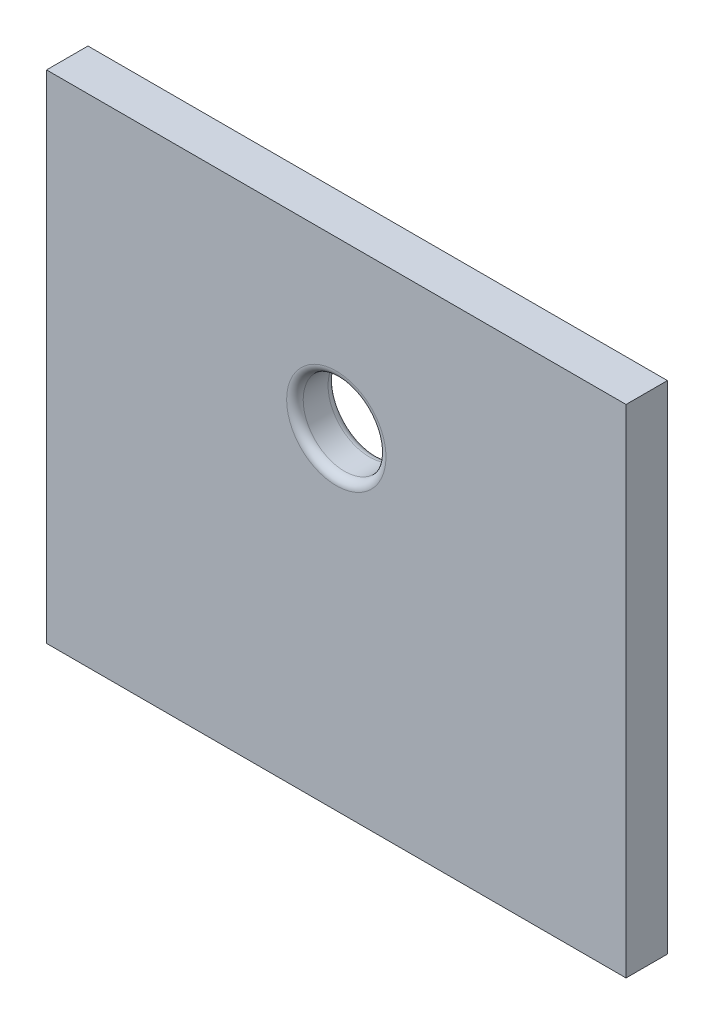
ISO-10303-21;
HEADER;
FILE_DESCRIPTION(('STEP AP214'),'2;1');
FILE_NAME('part.step','',(''),(''),'','','');
FILE_SCHEMA(('AUTOMOTIVE_DESIGN { 1 0 10303 214 1 1 1 1 }'));
ENDSEC;
DATA;
#1=APPLICATION_CONTEXT('core data for automotive mechanical design processes');
#2=APPLICATION_PROTOCOL_DEFINITION('international standard','automotive_design',2000,#1);
#3=PRODUCT_CONTEXT('',#1,'mechanical');
#4=PRODUCT('Part','Part','',(#3));
#5=PRODUCT_RELATED_PRODUCT_CATEGORY('part','',(#4));
#6=PRODUCT_DEFINITION_FORMATION('','',#4);
#7=PRODUCT_DEFINITION_CONTEXT('part definition',#1,'design');
#8=PRODUCT_DEFINITION('design','',#6,#7);
#9=PRODUCT_DEFINITION_SHAPE('','',#8);
#10=(LENGTH_UNIT() NAMED_UNIT(*) SI_UNIT(.MILLI.,.METRE.));
#11=(NAMED_UNIT(*) PLANE_ANGLE_UNIT() SI_UNIT($,.RADIAN.));
#12=(NAMED_UNIT(*) SI_UNIT($,.STERADIAN.) SOLID_ANGLE_UNIT());
#13=UNCERTAINTY_MEASURE_WITH_UNIT(LENGTH_MEASURE(1.E-05),#10,'distance_accuracy_value','');
#14=(GEOMETRIC_REPRESENTATION_CONTEXT(3) GLOBAL_UNCERTAINTY_ASSIGNED_CONTEXT((#13)) GLOBAL_UNIT_ASSIGNED_CONTEXT((#10,
#11,#12)) REPRESENTATION_CONTEXT('',''));
#15=CARTESIAN_POINT('',(0.,0.,0.));
#16=DIRECTION('',(0.,0.,1.));
#17=DIRECTION('',(1.,0.,0.));
#18=AXIS2_PLACEMENT_3D('',#15,#16,#17);
#19=CARTESIAN_POINT('',(0.,0.,5.));
#20=DIRECTION('',(0.,0.,-1.));
#21=DIRECTION('',(-1.,0.,0.));
#22=AXIS2_PLACEMENT_3D('',#19,#20,#21);
#23=PLANE('',#22);
#24=CARTESIAN_POINT('',(0.,10.,5.));
#25=DIRECTION('',(0.,0.,-1.));
#26=DIRECTION('',(-1.,0.,0.));
#27=AXIS2_PLACEMENT_3D('',#24,#25,#26);
#28=CIRCLE('',#27,6.);
#29=CARTESIAN_POINT('',(-6.,10.,5.));
#30=VERTEX_POINT('',#29);
#31=EDGE_CURVE('E11',#30,#30,#28,.T.);
#32=ORIENTED_EDGE('',*,*,#31,.T.);
#33=EDGE_LOOP('',(#32));
#34=FACE_BOUND('',#33,.T.);
#35=DIRECTION('',(0.,1.,0.));
#36=VECTOR('',#35,1.);
#37=CARTESIAN_POINT('',(35.,-30.,5.));
#38=LINE('',#37,#36);
#39=CARTESIAN_POINT('',(35.,-30.,5.));
#40=VERTEX_POINT('',#39);
#41=CARTESIAN_POINT('',(35.,30.,5.));
#42=VERTEX_POINT('',#41);
#43=EDGE_CURVE('E92',#40,#42,#38,.T.);
#44=ORIENTED_EDGE('',*,*,#43,.T.);
#45=DIRECTION('',(-1.,0.,0.));
#46=VECTOR('',#45,1.);
#47=CARTESIAN_POINT('',(-35.,30.,5.));
#48=LINE('',#47,#46);
#49=CARTESIAN_POINT('',(-35.,30.,5.));
#50=VERTEX_POINT('',#49);
#51=EDGE_CURVE('E88',#42,#50,#48,.T.);
#52=ORIENTED_EDGE('',*,*,#51,.T.);
#53=DIRECTION('',(0.,-1.,0.));
#54=VECTOR('',#53,1.);
#55=CARTESIAN_POINT('',(-35.,-30.,5.));
#56=LINE('',#55,#54);
#57=CARTESIAN_POINT('',(-35.,-30.,5.));
#58=VERTEX_POINT('',#57);
#59=EDGE_CURVE('E90',#50,#58,#56,.T.);
#60=ORIENTED_EDGE('',*,*,#59,.T.);
#61=DIRECTION('',(1.,0.,0.));
#62=VECTOR('',#61,1.);
#63=CARTESIAN_POINT('',(-35.,-30.,5.));
#64=LINE('',#63,#62);
#65=EDGE_CURVE('E57',#58,#40,#64,.T.);
#66=ORIENTED_EDGE('',*,*,#65,.T.);
#67=EDGE_LOOP('',(#44,#52,#60,#66));
#68=FACE_BOUND('',#67,.T.);
#69=ADVANCED_FACE('F40',(#34,#68),#23,.F.);
#70=CARTESIAN_POINT('',(0.,0.,0.));
#71=DIRECTION('',(0.,0.,-1.));
#72=DIRECTION('',(-1.,0.,0.));
#73=AXIS2_PLACEMENT_3D('',#70,#71,#72);
#74=PLANE('',#73);
#75=CARTESIAN_POINT('',(0.,10.,0.));
#76=DIRECTION('',(0.,0.,-1.));
#77=DIRECTION('',(-1.,0.,0.));
#78=AXIS2_PLACEMENT_3D('',#75,#76,#77);
#79=CIRCLE('',#78,6.);
#80=CARTESIAN_POINT('',(-6.,10.,0.));
#81=VERTEX_POINT('',#80);
#82=EDGE_CURVE('E116',#81,#81,#79,.F.);
#83=ORIENTED_EDGE('',*,*,#82,.T.);
#84=EDGE_LOOP('',(#83));
#85=FACE_BOUND('',#84,.T.);
#86=DIRECTION('',(0.,1.,0.));
#87=VECTOR('',#86,1.);
#88=CARTESIAN_POINT('',(35.,-30.,0.));
#89=LINE('',#88,#87);
#90=CARTESIAN_POINT('',(35.,-30.,0.));
#91=VERTEX_POINT('',#90);
#92=CARTESIAN_POINT('',(35.,30.,0.));
#93=VERTEX_POINT('',#92);
#94=EDGE_CURVE('E107',#91,#93,#89,.T.);
#95=ORIENTED_EDGE('',*,*,#94,.F.);
#96=DIRECTION('',(1.,0.,0.));
#97=VECTOR('',#96,1.);
#98=CARTESIAN_POINT('',(-35.,-30.,0.));
#99=LINE('',#98,#97);
#100=CARTESIAN_POINT('',(-35.,-30.,0.));
#101=VERTEX_POINT('',#100);
#102=EDGE_CURVE('E80',#101,#91,#99,.T.);
#103=ORIENTED_EDGE('',*,*,#102,.F.);
#104=DIRECTION('',(0.,-1.,0.));
#105=VECTOR('',#104,1.);
#106=CARTESIAN_POINT('',(-35.,-30.,0.));
#107=LINE('',#106,#105);
#108=CARTESIAN_POINT('',(-35.,30.,0.));
#109=VERTEX_POINT('',#108);
#110=EDGE_CURVE('E74',#109,#101,#107,.T.);
#111=ORIENTED_EDGE('',*,*,#110,.F.);
#112=DIRECTION('',(-1.,0.,0.));
#113=VECTOR('',#112,1.);
#114=CARTESIAN_POINT('',(-35.,30.,0.));
#115=LINE('',#114,#113);
#116=EDGE_CURVE('E97',#93,#109,#115,.T.);
#117=ORIENTED_EDGE('',*,*,#116,.F.);
#118=EDGE_LOOP('',(#95,#103,#111,#117));
#119=FACE_BOUND('',#118,.T.);
#120=ADVANCED_FACE('F132',(#85,#119),#74,.T.);
#121=CARTESIAN_POINT('',(35.,-30.,5.));
#122=DIRECTION('',(-1.,0.,0.));
#123=DIRECTION('',(0.,-1.,0.));
#124=AXIS2_PLACEMENT_3D('',#121,#122,#123);
#125=PLANE('',#124);
#126=ORIENTED_EDGE('',*,*,#94,.T.);
#127=DIRECTION('',(0.,0.,-1.));
#128=VECTOR('',#127,1.);
#129=CARTESIAN_POINT('',(35.,30.,5.));
#130=LINE('',#129,#128);
#131=EDGE_CURVE('E98',#42,#93,#130,.T.);
#132=ORIENTED_EDGE('',*,*,#131,.F.);
#133=ORIENTED_EDGE('',*,*,#43,.F.);
#134=DIRECTION('',(0.,0.,-1.));
#135=VECTOR('',#134,1.);
#136=CARTESIAN_POINT('',(35.,-30.,5.));
#137=LINE('',#136,#135);
#138=EDGE_CURVE('E103',#40,#91,#137,.T.);
#139=ORIENTED_EDGE('',*,*,#138,.T.);
#140=EDGE_LOOP('',(#126,#132,#133,#139));
#141=FACE_BOUND('',#140,.T.);
#142=ADVANCED_FACE('F135',(#141),#125,.F.);
#143=CARTESIAN_POINT('',(-35.,30.,5.));
#144=DIRECTION('',(0.,-1.,0.));
#145=DIRECTION('',(1.,0.,0.));
#146=AXIS2_PLACEMENT_3D('',#143,#144,#145);
#147=PLANE('',#146);
#148=ORIENTED_EDGE('',*,*,#116,.T.);
#149=DIRECTION('',(0.,0.,-1.));
#150=VECTOR('',#149,1.);
#151=CARTESIAN_POINT('',(-35.,30.,5.));
#152=LINE('',#151,#150);
#153=EDGE_CURVE('E95',#50,#109,#152,.T.);
#154=ORIENTED_EDGE('',*,*,#153,.F.);
#155=ORIENTED_EDGE('',*,*,#51,.F.);
#156=ORIENTED_EDGE('',*,*,#131,.T.);
#157=EDGE_LOOP('',(#148,#154,#155,#156));
#158=FACE_BOUND('',#157,.T.);
#159=ADVANCED_FACE('F96',(#158),#147,.F.);
#160=CARTESIAN_POINT('',(-35.,-30.,5.));
#161=DIRECTION('',(1.,0.,0.));
#162=DIRECTION('',(0.,1.,0.));
#163=AXIS2_PLACEMENT_3D('',#160,#161,#162);
#164=PLANE('',#163);
#165=ORIENTED_EDGE('',*,*,#110,.T.);
#166=DIRECTION('',(0.,0.,-1.));
#167=VECTOR('',#166,1.);
#168=CARTESIAN_POINT('',(-35.,-30.,5.));
#169=LINE('',#168,#167);
#170=EDGE_CURVE('E99',#58,#101,#169,.T.);
#171=ORIENTED_EDGE('',*,*,#170,.F.);
#172=ORIENTED_EDGE('',*,*,#59,.F.);
#173=ORIENTED_EDGE('',*,*,#153,.T.);
#174=EDGE_LOOP('',(#165,#171,#172,#173));
#175=FACE_BOUND('',#174,.T.);
#176=ADVANCED_FACE('F101',(#175),#164,.F.);
#177=CARTESIAN_POINT('',(-35.,-30.,5.));
#178=DIRECTION('',(0.,1.,0.));
#179=DIRECTION('',(0.,0.,1.));
#180=AXIS2_PLACEMENT_3D('',#177,#178,#179);
#181=PLANE('',#180);
#182=ORIENTED_EDGE('',*,*,#102,.T.);
#183=ORIENTED_EDGE('',*,*,#138,.F.);
#184=ORIENTED_EDGE('',*,*,#65,.F.);
#185=ORIENTED_EDGE('',*,*,#170,.T.);
#186=EDGE_LOOP('',(#182,#183,#184,#185));
#187=FACE_BOUND('',#186,.T.);
#188=ADVANCED_FACE('F139',(#187),#181,.F.);
#189=CARTESIAN_POINT('',(0.,10.,5.));
#190=DIRECTION('',(0.,0.,-1.));
#191=DIRECTION('',(-1.,0.,0.));
#192=AXIS2_PLACEMENT_3D('',#189,#190,#191);
#193=CYLINDRICAL_SURFACE('',#192,5.);
#194=CARTESIAN_POINT('',(0.,10.,1.));
#195=DIRECTION('',(0.,0.,-1.));
#196=DIRECTION('',(-1.,0.,0.));
#197=AXIS2_PLACEMENT_3D('',#194,#195,#196);
#198=CIRCLE('',#197,5.);
#199=CARTESIAN_POINT('',(-5.,10.,1.));
#200=VERTEX_POINT('',#199);
#201=EDGE_CURVE('E49',#200,#200,#198,.T.);
#202=ORIENTED_EDGE('',*,*,#201,.T.);
#203=EDGE_LOOP('',(#202));
#204=FACE_BOUND('',#203,.T.);
#205=CARTESIAN_POINT('',(0.,10.,4.));
#206=DIRECTION('',(0.,0.,-1.));
#207=DIRECTION('',(-1.,0.,0.));
#208=AXIS2_PLACEMENT_3D('',#205,#206,#207);
#209=CIRCLE('',#208,5.);
#210=CARTESIAN_POINT('',(-5.,10.,4.));
#211=VERTEX_POINT('',#210);
#212=EDGE_CURVE('E119',#211,#211,#209,.F.);
#213=ORIENTED_EDGE('',*,*,#212,.T.);
#214=EDGE_LOOP('',(#213));
#215=FACE_BOUND('',#214,.T.);
#216=ADVANCED_FACE('F124',(#204,#215),#193,.F.);
#217=CARTESIAN_POINT('',(0.,10.,1.));
#218=DIRECTION('',(0.,0.,-1.));
#219=DIRECTION('',(-1.,0.,0.));
#220=AXIS2_PLACEMENT_3D('',#217,#218,#219);
#221=TOROIDAL_SURFACE('',#220,6.,1.);
#222=ORIENTED_EDGE('',*,*,#201,.F.);
#223=EDGE_LOOP('',(#222));
#224=FACE_BOUND('',#223,.T.);
#225=ORIENTED_EDGE('',*,*,#82,.F.);
#226=EDGE_LOOP('',(#225));
#227=FACE_BOUND('',#226,.T.);
#228=ADVANCED_FACE('F127',(#224,#227),#221,.T.);
#229=CARTESIAN_POINT('',(0.,10.,4.));
#230=DIRECTION('',(0.,0.,-1.));
#231=DIRECTION('',(-1.,0.,0.));
#232=AXIS2_PLACEMENT_3D('',#229,#230,#231);
#233=TOROIDAL_SURFACE('',#232,6.,1.);
#234=ORIENTED_EDGE('',*,*,#31,.F.);
#235=EDGE_LOOP('',(#234));
#236=FACE_BOUND('',#235,.T.);
#237=ORIENTED_EDGE('',*,*,#212,.F.);
#238=EDGE_LOOP('',(#237));
#239=FACE_BOUND('',#238,.T.);
#240=ADVANCED_FACE('F42',(#236,#239),#233,.T.);
#241=CLOSED_SHELL('',(#69,#120,#142,#159,#176,#188,#216,#228,#240));
#242=MANIFOLD_SOLID_BREP('B2',#241);
#243=ADVANCED_BREP_SHAPE_REPRESENTATION('',(#18,#242),#14);
#244=SHAPE_DEFINITION_REPRESENTATION(#9,#243);
ENDSEC;
END-ISO-10303-21;
